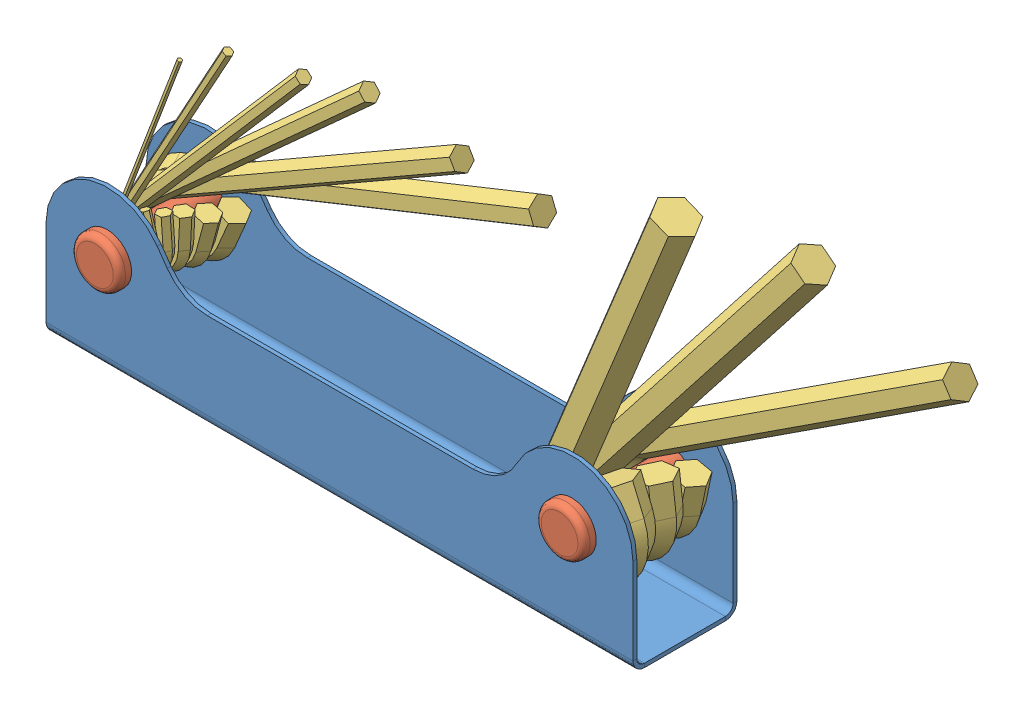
SolidWorks assembly part configs_&.SLDASM, configuration Default (file format 3100). Lengths in mm.
Overall size (226.89 104.92 38.17).
13 component instances, 4 part files, 27 mates.
Components (placement in the parent):
- Base Sheet Metal_&-1: Base Sheet Metal_&.SLDPRT [Default] at origin size (152.4 41.27 27)
- Pin_&-1: Pin_&.SLDPRT [Default] at (0 0 13.5) size (12.7 12.7 38.17)
- Pin_&-2: Pin_&.SLDPRT [Default] at (120.65 0 13.5) x (-0.979827 0.199848 0) z (0 0 1) size (12.7 12.7 38.17)
- Allen Wrench_&-1: Allen Wrench_&.SLDPRT [Size 6] at (0 0 -9.5) x (0.928451 0.371456 0) z (0 0 1) size (110.93 21.86 6)
- Allen Wrench_&-2: Allen Wrench_&.SLDPRT [Size 5] at (0 0 -4) x (0.867013 0.498285 0) z (0 0 1) size (99.77 19.55 5)
- Allen Wrench_&-3: Allen Wrench_&.SLDPRT [Size 4] at (0 0 0.5) x (0.741904 0.670506 0) z (0 0 1) size (88.62 17.24 4)
- Allen Wrench_&-4: Allen Wrench_&.SLDPRT [Size3] at (0 0 4) x (0.654512 0.756052 0) z (0 0 1) size (77.46 14.93 3)
- Washer_&-1: Washer_&.SLDPRT [Default] at (0 0 10.5) size (25 25 2)
- Allen Wrench_&-5: Allen Wrench_&.SLDPRT [Size2] at (0 0 6.5) x (0.48156 0.876413 0) z (0 0 1) size (66.31 12.62 2)
- Allen Wrench_&-6: Allen Wrench_&.SLDPRT [Size1] at (0 0 8) x (0.352678 0.935745 0) z (0 0 1) size (55.15 10.31 1)
- Allen Wrench_&-7: Allen Wrench_&.SLDPRT [Size7] at (120.65 0 -8) x (0.837608 0.546272 0) z (0 0 1) size (112.08 24.17 7)
- Allen Wrench_&-8: Allen Wrench_&.SLDPRT [Size8] at (120.65 0 -0.5) x (0.616566 0.787303 0) z (0 0 1) size (103.24 26.48 8)
- Allen Wrench_&-9: Allen Wrench_&.SLDPRT [Size9] at (120.65 0 8) x (0.377018 0.926206 0) z (0 0 1) size (94.39 28.78 9)
Mates (geometry in assembly coordinates):
- Coincident1: coincident aligned: plane of Base Sheet Metal_&-1; plane of assembly
- Coincident2: coincident aligned: plane of Base Sheet Metal_&-1; plane of assembly
- Coincident3: coincident aligned: plane of Base Sheet Metal_&-1; plane of assembly
- Coincident4: coincident aligned: axis of Base Sheet Metal_&-1; axis of Pin_&-1
- Coincident5: coincident anti-aligned: plane of Base Sheet Metal_&-1; plane of Pin_&-1
- Coincident6: coincident anti-aligned: axis of Base Sheet Metal_&-1; axis of Pin_&-2
- Coincident7: coincident anti-aligned: plane of Base Sheet Metal_&-1; plane of Pin_&-2
- Coincident8: coincident anti-aligned: axis of Pin_&-1; axis of Allen Wrench_&-1
- Coincident9: coincident anti-aligned: plane of Base Sheet Metal_&-1; plane of Allen Wrench_&-1
- Coincident10: coincident aligned: line of Allen Wrench_&-1; line of Allen Wrench_&-2
- Coincident11: coincident anti-aligned: plane of Allen Wrench_&-1; plane of Allen Wrench_&-2
- Coincident12: coincident aligned: line of Allen Wrench_&-2; line of Allen Wrench_&-3
- Coincident13: coincident anti-aligned: plane of Allen Wrench_&-2; plane of Allen Wrench_&-3
- Coincident14: coincident anti-aligned: plane of Allen Wrench_&-3; plane of Allen Wrench_&-4
- Coincident15: coincident aligned: line of Allen Wrench_&-2; line of Allen Wrench_&-4
- Coincident16: coincident aligned: line of Allen Wrench_&-4; axis of Washer_&-1
- Coincident17: coincident anti-aligned: plane of Base Sheet Metal_&-1; plane of Washer_&-1
- Coincident18: coincident aligned: line of Allen Wrench_&-3; line of Allen Wrench_&-5
- Coincident19: coincident anti-aligned: plane of Allen Wrench_&-4; plane of Allen Wrench_&-5
- Coincident20: coincident aligned: line of Allen Wrench_&-4; line of Allen Wrench_&-6
- Coincident21: coincident anti-aligned: plane of Allen Wrench_&-5; plane of Allen Wrench_&-6
- Coincident22: coincident anti-aligned: axis of Pin_&-2; axis of Allen Wrench_&-9
- Coincident23: coincident anti-aligned: plane of Base Sheet Metal_&-1; plane of Allen Wrench_&-9
- Coincident24: coincident anti-aligned: axis of Pin_&-2; axis of Allen Wrench_&-8
- Coincident25: coincident anti-aligned: plane of Allen Wrench_&-8; plane of Allen Wrench_&-9
- Coincident26: coincident anti-aligned: axis of Pin_&-2; axis of Allen Wrench_&-7
- Coincident27: coincident anti-aligned: plane of Allen Wrench_&-7; plane of Allen Wrench_&-8
